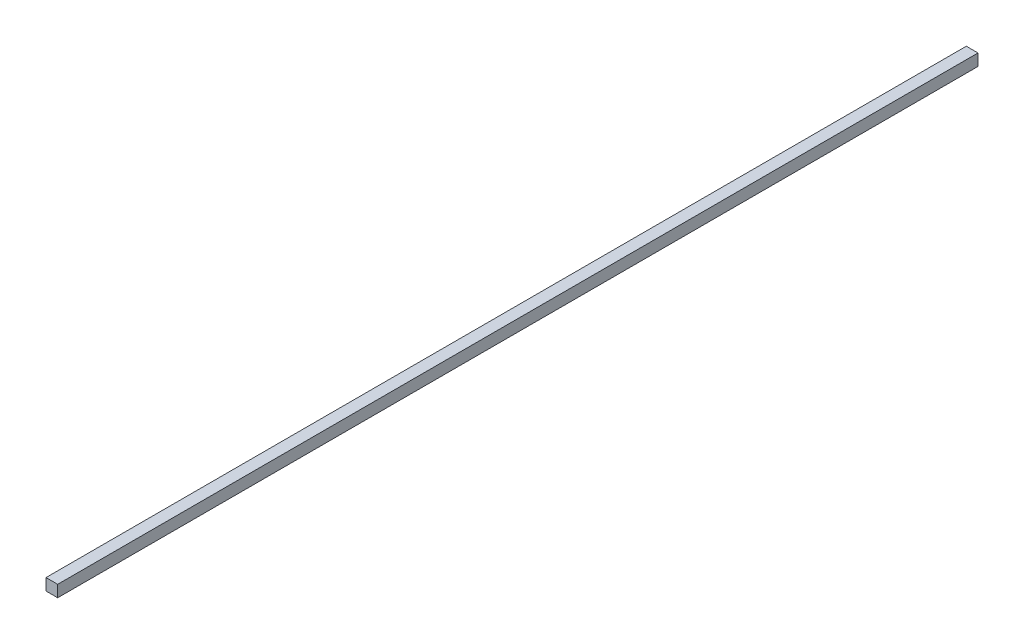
from build123d import *

# Parameters (mm, degrees)
SKETCH1_W      = 12.7
SKETCH1_H      = 12.7
EXTRUDE1_DEPTH = 999.998


with BuildPart() as part:
    # Sketch1 → Extrude1 (new body)
    with BuildSketch(Plane.XY):
        with Locations((6.35, 6.35)):
            Rectangle(SKETCH1_W, SKETCH1_H)
    extrude(amount=EXTRUDE1_DEPTH)


solid = part.part
